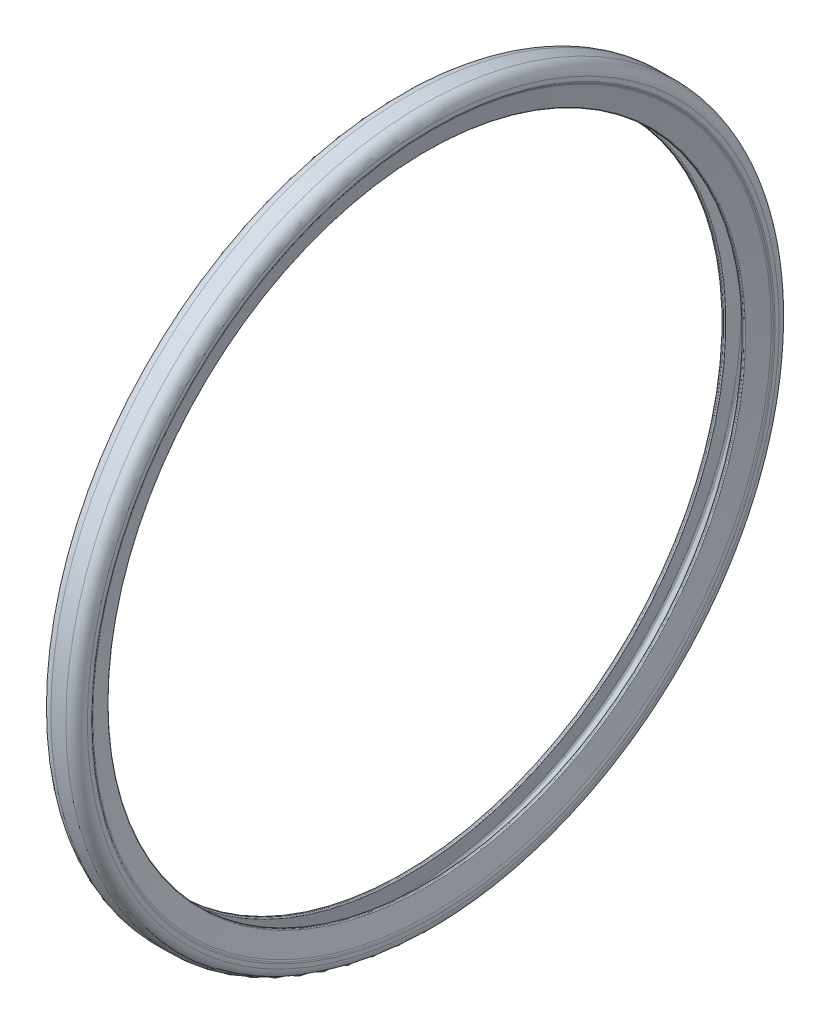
ISO-10303-21;
HEADER;
FILE_DESCRIPTION(('STEP AP214'),'2;1');
FILE_NAME('part.step','',(''),(''),'','','');
FILE_SCHEMA(('AUTOMOTIVE_DESIGN { 1 0 10303 214 1 1 1 1 }'));
ENDSEC;
DATA;
#1=APPLICATION_CONTEXT('core data for automotive mechanical design processes');
#2=APPLICATION_PROTOCOL_DEFINITION('international standard','automotive_design',2000,#1);
#3=PRODUCT_CONTEXT('',#1,'mechanical');
#4=PRODUCT('Part','Part','',(#3));
#5=PRODUCT_RELATED_PRODUCT_CATEGORY('part','',(#4));
#6=PRODUCT_DEFINITION_FORMATION('','',#4);
#7=PRODUCT_DEFINITION_CONTEXT('part definition',#1,'design');
#8=PRODUCT_DEFINITION('design','',#6,#7);
#9=PRODUCT_DEFINITION_SHAPE('','',#8);
#10=(LENGTH_UNIT() NAMED_UNIT(*) SI_UNIT(.MILLI.,.METRE.));
#11=(NAMED_UNIT(*) PLANE_ANGLE_UNIT() SI_UNIT($,.RADIAN.));
#12=(NAMED_UNIT(*) SI_UNIT($,.STERADIAN.) SOLID_ANGLE_UNIT());
#13=UNCERTAINTY_MEASURE_WITH_UNIT(LENGTH_MEASURE(1.E-05),#10,'distance_accuracy_value','');
#14=(GEOMETRIC_REPRESENTATION_CONTEXT(3) GLOBAL_UNCERTAINTY_ASSIGNED_CONTEXT((#13)) GLOBAL_UNIT_ASSIGNED_CONTEXT((#10,
#11,#12)) REPRESENTATION_CONTEXT('',''));
#15=CARTESIAN_POINT('',(0.,0.,0.));
#16=DIRECTION('',(0.,0.,1.));
#17=DIRECTION('',(1.,0.,0.));
#18=AXIS2_PLACEMENT_3D('',#15,#16,#17);
#19=CARTESIAN_POINT('',(-6.99739813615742,-289.525905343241,0.));
#20=DIRECTION('',(-1.,0.,0.));
#21=DIRECTION('',(0.,0.,1.));
#22=AXIS2_PLACEMENT_3D('',#19,#20,#21);
#23=TOROIDAL_SURFACE('',#22,322.386890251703,10.);
#24=CARTESIAN_POINT('',(-6.99739813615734,-289.525905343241,0.));
#25=DIRECTION('',(-1.,0.,0.));
#26=DIRECTION('',(0.,0.,1.));
#27=AXIS2_PLACEMENT_3D('',#24,#25,#26);
#28=CIRCLE('',#27,332.386890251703);
#29=CARTESIAN_POINT('',(-6.99739813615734,-289.525905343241,332.386890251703));
#30=VERTEX_POINT('',#29);
#31=EDGE_CURVE('E105',#30,#30,#28,.T.);
#32=ORIENTED_EDGE('',*,*,#31,.T.);
#33=EDGE_LOOP('',(#32));
#34=FACE_BOUND('',#33,.T.);
#35=CARTESIAN_POINT('',(-16.9973981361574,-289.525905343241,0.));
#36=DIRECTION('',(-1.,0.,0.));
#37=DIRECTION('',(0.,0.,1.));
#38=AXIS2_PLACEMENT_3D('',#35,#36,#37);
#39=CIRCLE('',#38,322.386890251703);
#40=CARTESIAN_POINT('',(-16.9973981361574,-289.525905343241,322.386890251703));
#41=VERTEX_POINT('',#40);
#42=EDGE_CURVE('E10',#41,#41,#39,.T.);
#43=ORIENTED_EDGE('',*,*,#42,.F.);
#44=EDGE_LOOP('',(#43));
#45=FACE_BOUND('',#44,.T.);
#46=ADVANCED_FACE('F35',(#34,#45),#23,.T.);
#47=CARTESIAN_POINT('',(-16.9973981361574,0.,0.));
#48=DIRECTION('',(-1.,0.,0.));
#49=DIRECTION('',(0.,0.,1.));
#50=AXIS2_PLACEMENT_3D('',#47,#48,#49);
#51=PLANE('',#50);
#52=ORIENTED_EDGE('',*,*,#42,.T.);
#53=EDGE_LOOP('',(#52));
#54=FACE_BOUND('',#53,.T.);
#55=CARTESIAN_POINT('',(-16.9973981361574,-289.525905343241,0.));
#56=DIRECTION('',(-1.,0.,0.));
#57=DIRECTION('',(0.,0.,1.));
#58=AXIS2_PLACEMENT_3D('',#55,#56,#57);
#59=CIRCLE('',#58,318.629299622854);
#60=CARTESIAN_POINT('',(-16.9973981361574,-289.525905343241,318.629299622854));
#61=VERTEX_POINT('',#60);
#62=EDGE_CURVE('E41',#61,#61,#59,.T.);
#63=ORIENTED_EDGE('',*,*,#62,.F.);
#64=EDGE_LOOP('',(#63));
#65=FACE_BOUND('',#64,.T.);
#66=ADVANCED_FACE('F123',(#54,#65),#51,.T.);
#67=CARTESIAN_POINT('',(-15.1150014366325,-289.525905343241,0.));
#68=DIRECTION('',(-1.,0.,0.));
#69=DIRECTION('',(0.,0.,1.));
#70=AXIS2_PLACEMENT_3D('',#67,#68,#69);
#71=TOROIDAL_SURFACE('',#70,318.629299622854,1.88239669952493);
#72=CARTESIAN_POINT('',(-16.5920155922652,-289.525905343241,0.));
#73=DIRECTION('',(-1.,0.,0.));
#74=DIRECTION('',(0.,0.,1.));
#75=AXIS2_PLACEMENT_3D('',#72,#73,#74);
#76=CIRCLE('',#75,317.462317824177);
#77=CARTESIAN_POINT('',(-16.5920155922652,-289.525905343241,317.462317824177));
#78=VERTEX_POINT('',#77);
#79=EDGE_CURVE('E45',#78,#78,#76,.T.);
#80=ORIENTED_EDGE('',*,*,#79,.F.);
#81=EDGE_LOOP('',(#80));
#82=FACE_BOUND('',#81,.T.);
#83=ORIENTED_EDGE('',*,*,#62,.T.);
#84=EDGE_LOOP('',(#83));
#85=FACE_BOUND('',#84,.T.);
#86=ADVANCED_FACE('F127',(#82,#85),#71,.T.);
#87=CARTESIAN_POINT('',(-19.4620725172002,-289.525905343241,0.));
#88=DIRECTION('',(-1.,0.,0.));
#89=DIRECTION('',(0.,0.,1.));
#90=AXIS2_PLACEMENT_3D('',#87,#88,#89);
#91=TOROIDAL_SURFACE('',#90,315.194699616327,3.65777515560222);
#92=CARTESIAN_POINT('',(-15.9276695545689,-289.525905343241,0.));
#93=DIRECTION('',(-1.,0.,0.));
#94=DIRECTION('',(0.,0.,1.));
#95=AXIS2_PLACEMENT_3D('',#92,#93,#94);
#96=CIRCLE('',#95,316.136673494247);
#97=CARTESIAN_POINT('',(-15.9276695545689,-289.525905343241,316.136673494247));
#98=VERTEX_POINT('',#97);
#99=EDGE_CURVE('E49',#98,#98,#96,.T.);
#100=ORIENTED_EDGE('',*,*,#99,.F.);
#101=EDGE_LOOP('',(#100));
#102=FACE_BOUND('',#101,.T.);
#103=ORIENTED_EDGE('',*,*,#79,.T.);
#104=EDGE_LOOP('',(#103));
#105=FACE_BOUND('',#104,.T.);
#106=ADVANCED_FACE('F131',(#102,#105),#91,.F.);
#107=CARTESIAN_POINT('',(-10.8865651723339,-289.525905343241,0.));
#108=DIRECTION('',(-1.,0.,0.));
#109=DIRECTION('',(0.,0.,1.));
#110=AXIS2_PLACEMENT_3D('',#107,#108,#109);
#111=CONICAL_SURFACE('',#110,297.221823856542,1.31033488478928);
#112=ORIENTED_EDGE('',*,*,#99,.T.);
#113=EDGE_LOOP('',(#112));
#114=FACE_BOUND('',#113,.T.);
#115=CARTESIAN_POINT('',(-10.8865651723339,-289.525905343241,0.));
#116=DIRECTION('',(-1.,0.,0.));
#117=DIRECTION('',(0.,0.,1.));
#118=AXIS2_PLACEMENT_3D('',#115,#116,#117);
#119=CIRCLE('',#118,297.221823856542);
#120=CARTESIAN_POINT('',(-10.8865651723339,-289.525905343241,297.221823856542));
#121=VERTEX_POINT('',#120);
#122=EDGE_CURVE('E54',#121,#121,#119,.T.);
#123=ORIENTED_EDGE('',*,*,#122,.F.);
#124=EDGE_LOOP('',(#123));
#125=FACE_BOUND('',#124,.T.);
#126=ADVANCED_FACE('F138',(#114,#125),#111,.F.);
#127=CARTESIAN_POINT('',(-9.92029392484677,-289.525905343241,0.));
#128=DIRECTION('',(-1.,0.,0.));
#129=DIRECTION('',(0.,0.,1.));
#130=AXIS2_PLACEMENT_3D('',#127,#128,#129);
#131=TOROIDAL_SURFACE('',#130,297.479350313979,0.999999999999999);
#132=ORIENTED_EDGE('',*,*,#122,.T.);
#133=EDGE_LOOP('',(#132));
#134=FACE_BOUND('',#133,.T.);
#135=CARTESIAN_POINT('',(-9.92029392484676,-289.525905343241,0.));
#136=DIRECTION('',(-1.,0.,0.));
#137=DIRECTION('',(0.,0.,1.));
#138=AXIS2_PLACEMENT_3D('',#135,#136,#137);
#139=CIRCLE('',#138,296.479350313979);
#140=CARTESIAN_POINT('',(-9.92029392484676,-289.525905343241,296.479350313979));
#141=VERTEX_POINT('',#140);
#142=EDGE_CURVE('E57',#141,#141,#139,.T.);
#143=ORIENTED_EDGE('',*,*,#142,.F.);
#144=EDGE_LOOP('',(#143));
#145=FACE_BOUND('',#144,.T.);
#146=ADVANCED_FACE('F142',(#134,#145),#131,.T.);
#147=CARTESIAN_POINT('',(-43.1075930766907,-289.525905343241,0.));
#148=DIRECTION('',(-1.,0.,0.));
#149=DIRECTION('',(0.,0.,1.));
#150=AXIS2_PLACEMENT_3D('',#147,#148,#149);
#151=CYLINDRICAL_SURFACE('',#150,296.479350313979);
#152=CARTESIAN_POINT('',(-8.88538783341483,-289.525905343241,0.));
#153=DIRECTION('',(-1.,0.,0.));
#154=DIRECTION('',(0.,0.,1.));
#155=AXIS2_PLACEMENT_3D('',#152,#153,#154);
#156=CIRCLE('',#155,296.479350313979);
#157=CARTESIAN_POINT('',(-8.88538783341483,-289.525905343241,296.479350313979));
#158=VERTEX_POINT('',#157);
#159=EDGE_CURVE('E60',#158,#158,#156,.T.);
#160=ORIENTED_EDGE('',*,*,#159,.F.);
#161=EDGE_LOOP('',(#160));
#162=FACE_BOUND('',#161,.T.);
#163=ORIENTED_EDGE('',*,*,#142,.T.);
#164=EDGE_LOOP('',(#163));
#165=FACE_BOUND('',#164,.T.);
#166=ADVANCED_FACE('F146',(#162,#165),#151,.F.);
#167=CARTESIAN_POINT('',(-8.88538783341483,-289.525905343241,0.));
#168=DIRECTION('',(-1.,0.,0.));
#169=DIRECTION('',(0.,0.,1.));
#170=AXIS2_PLACEMENT_3D('',#167,#168,#169);
#171=TOROIDAL_SURFACE('',#170,297.479350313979,0.999999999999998);
#172=CARTESIAN_POINT('',(-7.91911658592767,-289.525905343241,0.));
#173=DIRECTION('',(-1.,0.,0.));
#174=DIRECTION('',(0.,0.,1.));
#175=AXIS2_PLACEMENT_3D('',#172,#173,#174);
#176=CIRCLE('',#175,297.736876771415);
#177=CARTESIAN_POINT('',(-7.91911658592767,-289.525905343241,297.736876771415));
#178=VERTEX_POINT('',#177);
#179=EDGE_CURVE('E63',#178,#178,#176,.T.);
#180=ORIENTED_EDGE('',*,*,#179,.F.);
#181=EDGE_LOOP('',(#180));
#182=FACE_BOUND('',#181,.T.);
#183=ORIENTED_EDGE('',*,*,#159,.T.);
#184=EDGE_LOOP('',(#183));
#185=FACE_BOUND('',#184,.T.);
#186=ADVANCED_FACE('F150',(#182,#185),#171,.T.);
#187=CARTESIAN_POINT('',(-7.91911658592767,-289.525905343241,0.));
#188=DIRECTION('',(-1.,0.,0.));
#189=DIRECTION('',(0.,0.,1.));
#190=AXIS2_PLACEMENT_3D('',#187,#188,#189);
#191=CONICAL_SURFACE('',#190,297.736876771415,1.31033488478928);
#192=CARTESIAN_POINT('',(-13.0623874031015,-289.525905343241,0.));
#193=DIRECTION('',(-1.,0.,0.));
#194=DIRECTION('',(0.,0.,1.));
#195=AXIS2_PLACEMENT_3D('',#192,#193,#194);
#196=CIRCLE('',#195,317.03506755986);
#197=CARTESIAN_POINT('',(-13.0623874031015,-289.525905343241,317.03506755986));
#198=VERTEX_POINT('',#197);
#199=EDGE_CURVE('E66',#198,#198,#196,.T.);
#200=ORIENTED_EDGE('',*,*,#199,.F.);
#201=EDGE_LOOP('',(#200));
#202=FACE_BOUND('',#201,.T.);
#203=ORIENTED_EDGE('',*,*,#179,.T.);
#204=EDGE_LOOP('',(#203));
#205=FACE_BOUND('',#204,.T.);
#206=ADVANCED_FACE('F154',(#202,#205),#191,.T.);
#207=CARTESIAN_POINT('',(-11.1298449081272,-289.525905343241,0.));
#208=DIRECTION('',(-1.,0.,0.));
#209=DIRECTION('',(0.,0.,1.));
#210=AXIS2_PLACEMENT_3D('',#207,#208,#209);
#211=TOROIDAL_SURFACE('',#210,317.550120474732,2.);
#212=CARTESIAN_POINT('',(-12.4111606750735,-289.525905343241,0.));
#213=DIRECTION('',(-1.,0.,0.));
#214=DIRECTION('',(0.,0.,1.));
#215=AXIS2_PLACEMENT_3D('',#212,#213,#214);
#216=CIRCLE('',#215,319.085773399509);
#217=CARTESIAN_POINT('',(-12.4111606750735,-289.525905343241,319.085773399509));
#218=VERTEX_POINT('',#217);
#219=EDGE_CURVE('E69',#218,#218,#216,.T.);
#220=ORIENTED_EDGE('',*,*,#219,.F.);
#221=EDGE_LOOP('',(#220));
#222=FACE_BOUND('',#221,.T.);
#223=ORIENTED_EDGE('',*,*,#199,.T.);
#224=EDGE_LOOP('',(#223));
#225=FACE_BOUND('',#224,.T.);
#226=ADVANCED_FACE('F158',(#222,#225),#211,.F.);
#227=CARTESIAN_POINT('',(0.891203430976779,-289.525905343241,0.));
#228=DIRECTION('',(-1.,0.,0.));
#229=DIRECTION('',(0.,0.,1.));
#230=AXIS2_PLACEMENT_3D('',#227,#228,#229);
#231=TOROIDAL_SURFACE('',#230,303.142931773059,20.7636001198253);
#232=ORIENTED_EDGE('',*,*,#219,.T.);
#233=EDGE_LOOP('',(#232));
#234=FACE_BOUND('',#233,.T.);
#235=CARTESIAN_POINT('',(12.5524141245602,-289.525905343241,0.));
#236=DIRECTION('',(-1.,0.,0.));
#237=DIRECTION('',(0.,0.,1.));
#238=AXIS2_PLACEMENT_3D('',#235,#236,#237);
#239=CIRCLE('',#238,320.322665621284);
#240=CARTESIAN_POINT('',(12.5524141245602,-289.525905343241,320.322665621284));
#241=VERTEX_POINT('',#240);
#242=EDGE_CURVE('E72',#241,#241,#239,.T.);
#243=ORIENTED_EDGE('',*,*,#242,.F.);
#244=EDGE_LOOP('',(#243));
#245=FACE_BOUND('',#244,.T.);
#246=ADVANCED_FACE('F162',(#234,#245),#231,.F.);
#247=CARTESIAN_POINT('',(11.4291782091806,-289.525905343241,0.));
#248=DIRECTION('',(-1.,0.,0.));
#249=DIRECTION('',(0.,0.,1.));
#250=AXIS2_PLACEMENT_3D('',#247,#248,#249);
#251=TOROIDAL_SURFACE('',#250,318.667872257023,2.00000000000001);
#252=CARTESIAN_POINT('',(13.379556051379,-289.525905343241,0.));
#253=DIRECTION('',(-1.,0.,0.));
#254=DIRECTION('',(0.,0.,1.));
#255=AXIS2_PLACEMENT_3D('',#252,#253,#254);
#256=CIRCLE('',#255,318.225123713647);
#257=CARTESIAN_POINT('',(13.379556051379,-289.525905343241,318.225123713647));
#258=VERTEX_POINT('',#257);
#259=EDGE_CURVE('E75',#258,#258,#256,.T.);
#260=ORIENTED_EDGE('',*,*,#259,.F.);
#261=EDGE_LOOP('',(#260));
#262=FACE_BOUND('',#261,.T.);
#263=ORIENTED_EDGE('',*,*,#242,.T.);
#264=EDGE_LOOP('',(#263));
#265=FACE_BOUND('',#264,.T.);
#266=ADVANCED_FACE('F166',(#262,#265),#251,.F.);
#267=CARTESIAN_POINT('',(7.91911658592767,-289.525905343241,0.));
#268=DIRECTION('',(1.,0.,0.));
#269=DIRECTION('',(0.,0.,-1.));
#270=AXIS2_PLACEMENT_3D('',#267,#268,#269);
#271=CONICAL_SURFACE('',#270,297.736876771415,1.31033488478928);
#272=ORIENTED_EDGE('',*,*,#259,.T.);
#273=EDGE_LOOP('',(#272));
#274=FACE_BOUND('',#273,.T.);
#275=CARTESIAN_POINT('',(7.91911658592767,-289.525905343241,0.));
#276=DIRECTION('',(-1.,0.,0.));
#277=DIRECTION('',(0.,0.,1.));
#278=AXIS2_PLACEMENT_3D('',#275,#276,#277);
#279=CIRCLE('',#278,297.736876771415);
#280=CARTESIAN_POINT('',(7.91911658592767,-289.525905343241,297.736876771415));
#281=VERTEX_POINT('',#280);
#282=EDGE_CURVE('E78',#281,#281,#279,.T.);
#283=ORIENTED_EDGE('',*,*,#282,.F.);
#284=EDGE_LOOP('',(#283));
#285=FACE_BOUND('',#284,.T.);
#286=ADVANCED_FACE('F170',(#274,#285),#271,.T.);
#287=CARTESIAN_POINT('',(8.88538783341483,-289.525905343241,0.));
#288=DIRECTION('',(-1.,0.,0.));
#289=DIRECTION('',(0.,0.,1.));
#290=AXIS2_PLACEMENT_3D('',#287,#288,#289);
#291=TOROIDAL_SURFACE('',#290,297.479350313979,0.999999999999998);
#292=ORIENTED_EDGE('',*,*,#282,.T.);
#293=EDGE_LOOP('',(#292));
#294=FACE_BOUND('',#293,.T.);
#295=CARTESIAN_POINT('',(8.88538783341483,-289.525905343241,0.));
#296=DIRECTION('',(-1.,0.,0.));
#297=DIRECTION('',(0.,0.,1.));
#298=AXIS2_PLACEMENT_3D('',#295,#296,#297);
#299=CIRCLE('',#298,296.479350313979);
#300=CARTESIAN_POINT('',(8.88538783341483,-289.525905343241,296.479350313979));
#301=VERTEX_POINT('',#300);
#302=EDGE_CURVE('E81',#301,#301,#299,.T.);
#303=ORIENTED_EDGE('',*,*,#302,.F.);
#304=EDGE_LOOP('',(#303));
#305=FACE_BOUND('',#304,.T.);
#306=ADVANCED_FACE('F174',(#294,#305),#291,.T.);
#307=CARTESIAN_POINT('',(-43.1075930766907,-289.525905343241,0.));
#308=DIRECTION('',(-1.,0.,0.));
#309=DIRECTION('',(0.,0.,1.));
#310=AXIS2_PLACEMENT_3D('',#307,#308,#309);
#311=CYLINDRICAL_SURFACE('',#310,296.479350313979);
#312=ORIENTED_EDGE('',*,*,#302,.T.);
#313=EDGE_LOOP('',(#312));
#314=FACE_BOUND('',#313,.T.);
#315=CARTESIAN_POINT('',(9.92029392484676,-289.525905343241,0.));
#316=DIRECTION('',(-1.,0.,0.));
#317=DIRECTION('',(0.,0.,1.));
#318=AXIS2_PLACEMENT_3D('',#315,#316,#317);
#319=CIRCLE('',#318,296.479350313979);
#320=CARTESIAN_POINT('',(9.92029392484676,-289.525905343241,296.479350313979));
#321=VERTEX_POINT('',#320);
#322=EDGE_CURVE('E84',#321,#321,#319,.T.);
#323=ORIENTED_EDGE('',*,*,#322,.F.);
#324=EDGE_LOOP('',(#323));
#325=FACE_BOUND('',#324,.T.);
#326=ADVANCED_FACE('F178',(#314,#325),#311,.F.);
#327=CARTESIAN_POINT('',(9.92029392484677,-289.525905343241,0.));
#328=DIRECTION('',(-1.,0.,0.));
#329=DIRECTION('',(0.,0.,1.));
#330=AXIS2_PLACEMENT_3D('',#327,#328,#329);
#331=TOROIDAL_SURFACE('',#330,297.479350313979,0.999999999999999);
#332=CARTESIAN_POINT('',(10.8865651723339,-289.525905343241,0.));
#333=DIRECTION('',(-1.,0.,0.));
#334=DIRECTION('',(0.,0.,1.));
#335=AXIS2_PLACEMENT_3D('',#332,#333,#334);
#336=CIRCLE('',#335,297.221823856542);
#337=CARTESIAN_POINT('',(10.8865651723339,-289.525905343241,297.221823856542));
#338=VERTEX_POINT('',#337);
#339=EDGE_CURVE('E87',#338,#338,#336,.T.);
#340=ORIENTED_EDGE('',*,*,#339,.F.);
#341=EDGE_LOOP('',(#340));
#342=FACE_BOUND('',#341,.T.);
#343=ORIENTED_EDGE('',*,*,#322,.T.);
#344=EDGE_LOOP('',(#343));
#345=FACE_BOUND('',#344,.T.);
#346=ADVANCED_FACE('F182',(#342,#345),#331,.T.);
#347=CARTESIAN_POINT('',(10.8865651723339,-289.525905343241,0.));
#348=DIRECTION('',(1.,0.,0.));
#349=DIRECTION('',(0.,0.,-1.));
#350=AXIS2_PLACEMENT_3D('',#347,#348,#349);
#351=CONICAL_SURFACE('',#350,297.221823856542,1.31033488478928);
#352=CARTESIAN_POINT('',(15.9276695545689,-289.525905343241,0.));
#353=DIRECTION('',(-1.,0.,0.));
#354=DIRECTION('',(0.,0.,1.));
#355=AXIS2_PLACEMENT_3D('',#352,#353,#354);
#356=CIRCLE('',#355,316.136673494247);
#357=CARTESIAN_POINT('',(15.9276695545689,-289.525905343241,316.136673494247));
#358=VERTEX_POINT('',#357);
#359=EDGE_CURVE('E90',#358,#358,#356,.T.);
#360=ORIENTED_EDGE('',*,*,#359,.F.);
#361=EDGE_LOOP('',(#360));
#362=FACE_BOUND('',#361,.T.);
#363=ORIENTED_EDGE('',*,*,#339,.T.);
#364=EDGE_LOOP('',(#363));
#365=FACE_BOUND('',#364,.T.);
#366=ADVANCED_FACE('F186',(#362,#365),#351,.F.);
#367=CARTESIAN_POINT('',(19.4620725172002,-289.525905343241,0.));
#368=DIRECTION('',(-1.,0.,0.));
#369=DIRECTION('',(0.,0.,1.));
#370=AXIS2_PLACEMENT_3D('',#367,#368,#369);
#371=TOROIDAL_SURFACE('',#370,315.194699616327,3.65777515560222);
#372=ORIENTED_EDGE('',*,*,#359,.T.);
#373=EDGE_LOOP('',(#372));
#374=FACE_BOUND('',#373,.T.);
#375=CARTESIAN_POINT('',(16.5920155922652,-289.525905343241,0.));
#376=DIRECTION('',(-1.,0.,0.));
#377=DIRECTION('',(0.,0.,1.));
#378=AXIS2_PLACEMENT_3D('',#375,#376,#377);
#379=CIRCLE('',#378,317.462317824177);
#380=CARTESIAN_POINT('',(16.5920155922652,-289.525905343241,317.462317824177));
#381=VERTEX_POINT('',#380);
#382=EDGE_CURVE('E93',#381,#381,#379,.T.);
#383=ORIENTED_EDGE('',*,*,#382,.F.);
#384=EDGE_LOOP('',(#383));
#385=FACE_BOUND('',#384,.T.);
#386=ADVANCED_FACE('F190',(#374,#385),#371,.F.);
#387=CARTESIAN_POINT('',(15.1150014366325,-289.525905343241,0.));
#388=DIRECTION('',(-1.,0.,0.));
#389=DIRECTION('',(0.,0.,1.));
#390=AXIS2_PLACEMENT_3D('',#387,#388,#389);
#391=TOROIDAL_SURFACE('',#390,318.629299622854,1.88239669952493);
#392=ORIENTED_EDGE('',*,*,#382,.T.);
#393=EDGE_LOOP('',(#392));
#394=FACE_BOUND('',#393,.T.);
#395=CARTESIAN_POINT('',(16.9973981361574,-289.525905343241,0.));
#396=DIRECTION('',(-1.,0.,0.));
#397=DIRECTION('',(0.,0.,1.));
#398=AXIS2_PLACEMENT_3D('',#395,#396,#397);
#399=CIRCLE('',#398,318.629299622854);
#400=CARTESIAN_POINT('',(16.9973981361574,-289.525905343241,318.629299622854));
#401=VERTEX_POINT('',#400);
#402=EDGE_CURVE('E96',#401,#401,#399,.T.);
#403=ORIENTED_EDGE('',*,*,#402,.F.);
#404=EDGE_LOOP('',(#403));
#405=FACE_BOUND('',#404,.T.);
#406=ADVANCED_FACE('F194',(#394,#405),#391,.T.);
#407=CARTESIAN_POINT('',(16.9973981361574,0.,0.));
#408=DIRECTION('',(-1.,0.,0.));
#409=DIRECTION('',(0.,0.,1.));
#410=AXIS2_PLACEMENT_3D('',#407,#408,#409);
#411=PLANE('',#410);
#412=CARTESIAN_POINT('',(16.9973981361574,-289.525905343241,0.));
#413=DIRECTION('',(-1.,0.,0.));
#414=DIRECTION('',(0.,0.,1.));
#415=AXIS2_PLACEMENT_3D('',#412,#413,#414);
#416=CIRCLE('',#415,322.386890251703);
#417=CARTESIAN_POINT('',(16.9973981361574,-289.525905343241,322.386890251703));
#418=VERTEX_POINT('',#417);
#419=EDGE_CURVE('E99',#418,#418,#416,.T.);
#420=ORIENTED_EDGE('',*,*,#419,.F.);
#421=EDGE_LOOP('',(#420));
#422=FACE_BOUND('',#421,.T.);
#423=ORIENTED_EDGE('',*,*,#402,.T.);
#424=EDGE_LOOP('',(#423));
#425=FACE_BOUND('',#424,.T.);
#426=ADVANCED_FACE('F119',(#422,#425),#411,.F.);
#427=CARTESIAN_POINT('',(6.99739813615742,-289.525905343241,0.));
#428=DIRECTION('',(-1.,0.,0.));
#429=DIRECTION('',(0.,0.,1.));
#430=AXIS2_PLACEMENT_3D('',#427,#428,#429);
#431=TOROIDAL_SURFACE('',#430,322.386890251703,10.);
#432=CARTESIAN_POINT('',(6.99739813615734,-289.525905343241,0.));
#433=DIRECTION('',(-1.,0.,0.));
#434=DIRECTION('',(0.,0.,1.));
#435=AXIS2_PLACEMENT_3D('',#432,#433,#434);
#436=CIRCLE('',#435,332.386890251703);
#437=CARTESIAN_POINT('',(6.99739813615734,-289.525905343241,332.386890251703));
#438=VERTEX_POINT('',#437);
#439=EDGE_CURVE('E102',#438,#438,#436,.T.);
#440=ORIENTED_EDGE('',*,*,#439,.F.);
#441=EDGE_LOOP('',(#440));
#442=FACE_BOUND('',#441,.T.);
#443=ORIENTED_EDGE('',*,*,#419,.T.);
#444=EDGE_LOOP('',(#443));
#445=FACE_BOUND('',#444,.T.);
#446=ADVANCED_FACE('F113',(#442,#445),#431,.T.);
#447=CARTESIAN_POINT('',(-43.1075930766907,-289.525905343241,0.));
#448=DIRECTION('',(-1.,0.,0.));
#449=DIRECTION('',(0.,0.,1.));
#450=AXIS2_PLACEMENT_3D('',#447,#448,#449);
#451=CYLINDRICAL_SURFACE('',#450,332.386890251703);
#452=ORIENTED_EDGE('',*,*,#439,.T.);
#453=EDGE_LOOP('',(#452));
#454=FACE_BOUND('',#453,.T.);
#455=ORIENTED_EDGE('',*,*,#31,.F.);
#456=EDGE_LOOP('',(#455));
#457=FACE_BOUND('',#456,.T.);
#458=ADVANCED_FACE('F111',(#454,#457),#451,.T.);
#459=CLOSED_SHELL('',(#46,#66,#86,#106,#126,#146,#166,#186,#206,#226,#246,#266,#286,#306,#326,
#346,#366,#386,#406,#426,#446,#458));
#460=MANIFOLD_SOLID_BREP('B2',#459);
#461=ADVANCED_BREP_SHAPE_REPRESENTATION('',(#18,#460),#14);
#462=SHAPE_DEFINITION_REPRESENTATION(#9,#461);
ENDSEC;
END-ISO-10303-21;
